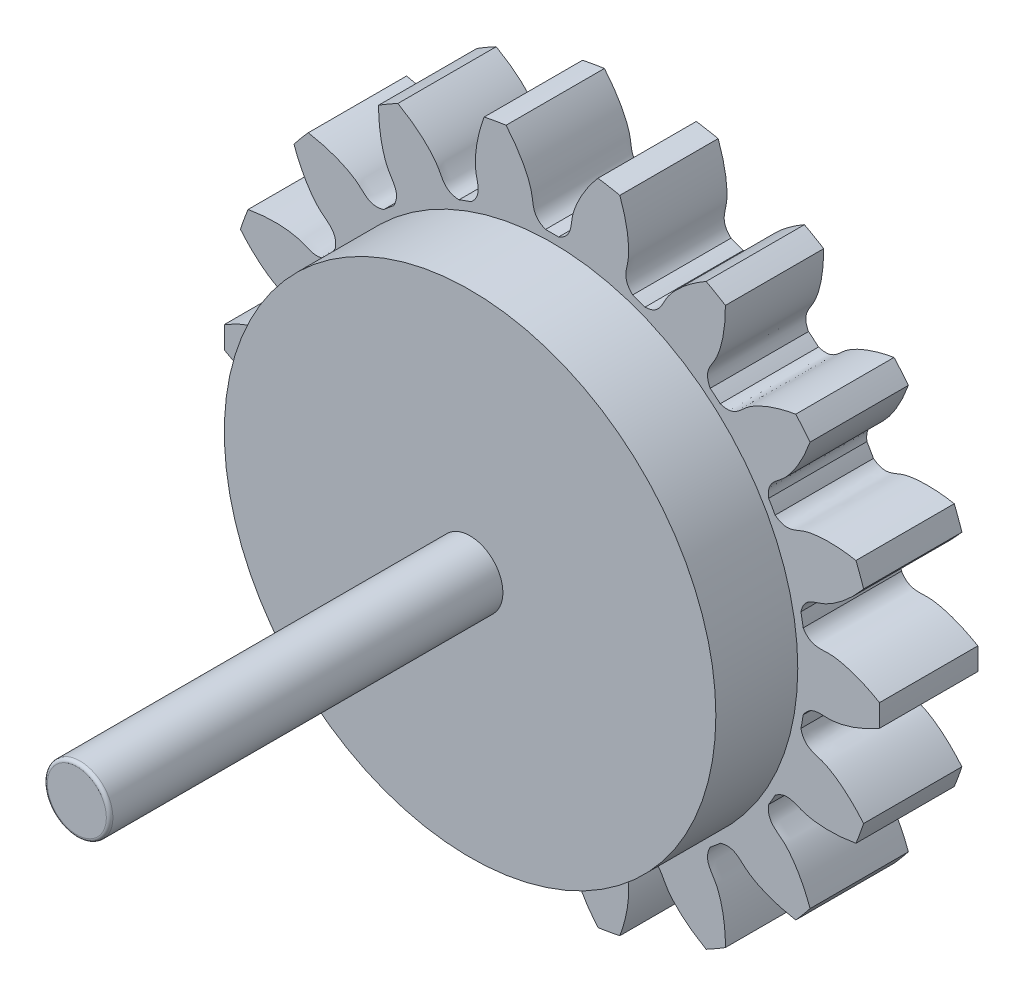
from build123d import *

# Parameters (mm, degrees)
SKETCH_1_R               = 20
EXTRUDE_1_DEPTH          = 6
CUT_EXTRUDE_1_DEPTH      = 29.91366459
PATTERN_CIRCULAR_1_COUNT = 18
SKETCH_4_R               = 2
EXTRUDE_2_DEPTH          = 29
FILLET_1_R               = 0.2
SKETCH_7_R               = 15
SKETCH_7_R_2             = 2
EXTRUDE_3_DEPTH          = 5


with BuildPart() as part:
    # Sketch 1 → Extrude 1 (new body)
    with BuildSketch(Plane.XY):
        Circle(SKETCH_1_R)
    extrude(amount=EXTRUDE_1_DEPTH)

    # Sketch 2 → Cut-Extrude 1 (cut, through all)
    with BuildSketch(Plane.XY):
        with BuildLine():
            ThreePointArc((0.398807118, 15.494868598), (0, 15.5), (-0.398807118, 15.494868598))
            add(Edge.make_bspline(
                [(-0.398807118, 15.494868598), (-1.23020808, 15.837360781), (-1.1255781, 16.477399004), (-1.263665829, 17.085190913), (-1.27750304, 17.141013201), (-1.294215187, 17.203080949), (-1.314049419, 17.271300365), (-1.337260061, 17.345568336), (-1.364095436, 17.425774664), (-1.394801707, 17.511801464), (-1.429621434, 17.603523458), (-1.46879375, 17.700807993), (-1.512554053, 17.803515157), (-1.561133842, 17.911497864), (-1.614760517, 18.02460196), (-1.673657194, 18.142666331), (-1.738042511, 18.265523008), (-1.80813045, 18.392997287), (-1.884130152, 18.524907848), (-1.96624574, 18.661066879), (-2.054676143, 18.801280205), (-2.149614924, 18.945347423), (-2.25125011, 19.09306204), (-2.359764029, 19.244211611), (-2.475333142, 19.398577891), (-2.598127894, 19.555936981), (-2.728312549, 19.716059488), (-2.866045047, 19.878710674), (-3.011476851, 20.043650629), (-3.164752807, 20.210634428), (-3.326011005, 20.379412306), (-3.495382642, 20.549729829), (-3.672991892, 20.72132807), (-3.858955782, 20.893943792), (-4.053384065, 21.067309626), (-4.256379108, 21.241154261), (-4.468035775, 21.415202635), (-4.68844132, 21.58917612), (-4.917675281, 21.762792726), (-5.155809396, 21.935767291), (-5.402907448, 22.107811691), (-5.748150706, 22.338079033), (-6.015110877, 22.504667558), (-6.197121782, 22.613356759)],
                knots=[0, 0, 0, 0, 0.187591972, 0.192996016, 0.1991206, 0.205965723, 0.213531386, 0.221817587, 0.230824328, 0.240551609, 0.250999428, 0.262167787, 0.274056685, 0.286666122, 0.299996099, 0.314046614, 0.32881767, 0.344309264, 0.360521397, 0.37745407, 0.395107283, 0.413481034, 0.432575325, 0.452390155, 0.472925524, 0.494181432, 0.51615788, 0.538854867, 0.562272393, 0.586410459, 0.611269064, 0.636848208, 0.663147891, 0.690168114, 0.717908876, 0.746370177, 0.775552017, 0.805454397, 0.836077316, 0.867420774, 0.899484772, 0.932269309, 1, 1, 1, 1], degree=3))
            ThreePointArc((-6.197121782, 22.613356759), (0, 23.447136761), (6.197121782, 22.613356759))
            add(Edge.make_bspline(
                [(0.398807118, 15.494868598), (1.23020808, 15.837360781), (1.1255781, 16.477399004), (1.263665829, 17.085190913), (1.27750304, 17.141013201), (1.294215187, 17.203080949), (1.314049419, 17.271300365), (1.337260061, 17.345568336), (1.364095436, 17.425774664), (1.394801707, 17.511801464), (1.429621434, 17.603523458), (1.46879375, 17.700807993), (1.512554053, 17.803515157), (1.561133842, 17.911497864), (1.614760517, 18.02460196), (1.673657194, 18.142666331), (1.738042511, 18.265523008), (1.80813045, 18.392997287), (1.884130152, 18.524907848), (1.96624574, 18.661066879), (2.054676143, 18.801280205), (2.149614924, 18.945347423), (2.25125011, 19.09306204), (2.359764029, 19.244211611), (2.475333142, 19.398577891), (2.598127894, 19.555936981), (2.728312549, 19.716059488), (2.866045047, 19.878710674), (3.011476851, 20.043650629), (3.164752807, 20.210634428), (3.326011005, 20.379412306), (3.495382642, 20.549729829), (3.672991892, 20.72132807), (3.858955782, 20.893943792), (4.053384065, 21.067309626), (4.256379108, 21.241154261), (4.468035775, 21.415202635), (4.68844132, 21.58917612), (4.917675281, 21.762792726), (5.155809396, 21.935767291), (5.402907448, 22.107811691), (5.748150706, 22.338079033), (6.015110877, 22.504667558), (6.197121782, 22.613356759)],
                knots=[0, 0, 0, 0, 0.187591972, 0.192996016, 0.1991206, 0.205965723, 0.213531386, 0.221817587, 0.230824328, 0.240551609, 0.250999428, 0.262167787, 0.274056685, 0.286666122, 0.299996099, 0.314046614, 0.32881767, 0.344309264, 0.360521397, 0.37745407, 0.395107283, 0.413481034, 0.432575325, 0.452390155, 0.472925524, 0.494181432, 0.51615788, 0.538854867, 0.562272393, 0.586410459, 0.611269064, 0.636848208, 0.663147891, 0.690168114, 0.717908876, 0.746370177, 0.775552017, 0.805454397, 0.836077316, 0.867420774, 0.899484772, 0.932269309, 1, 1, 1, 1], degree=3))
        make_face()
    cut_extrude_1 = extrude(amount=CUT_EXTRUDE_1_DEPTH, mode=Mode.SUBTRACT)

    # Pattern Circular 1: Cut-Extrude 1 ×18 about axis
    pattern_circular_1_axis = Axis((0, 0, 6), (0, 0, -1))
    for i in range(1, PATTERN_CIRCULAR_1_COUNT):
        add(cut_extrude_1.rotate(pattern_circular_1_axis, i * 360 / PATTERN_CIRCULAR_1_COUNT), mode=Mode.SUBTRACT)

    # Sketch 4 → Extrude 2 (add)
    with BuildSketch(Plane.XY.offset(6)):
        with Locations(Location((0, 0, 0), (0, 0, 180))):
            Circle(SKETCH_4_R)
    extrude(amount=EXTRUDE_2_DEPTH)

    # Fillet 1
    fillet_1_edges = [part.edges().sort_by_distance(p)[0] for p in [
        (2, 0, 35),
    ]]
    fillet(fillet_1_edges, radius=FILLET_1_R)

    # Sketch 7 → Extrude 3 (add)
    with BuildSketch(Plane.XY.offset(6)):
        Circle(SKETCH_7_R)
        with Locations(Location((0, 0, 0), (0, 0, 180))):
            Circle(SKETCH_7_R_2, mode=Mode.SUBTRACT)
    extrude(amount=EXTRUDE_3_DEPTH)


solid = part.part
